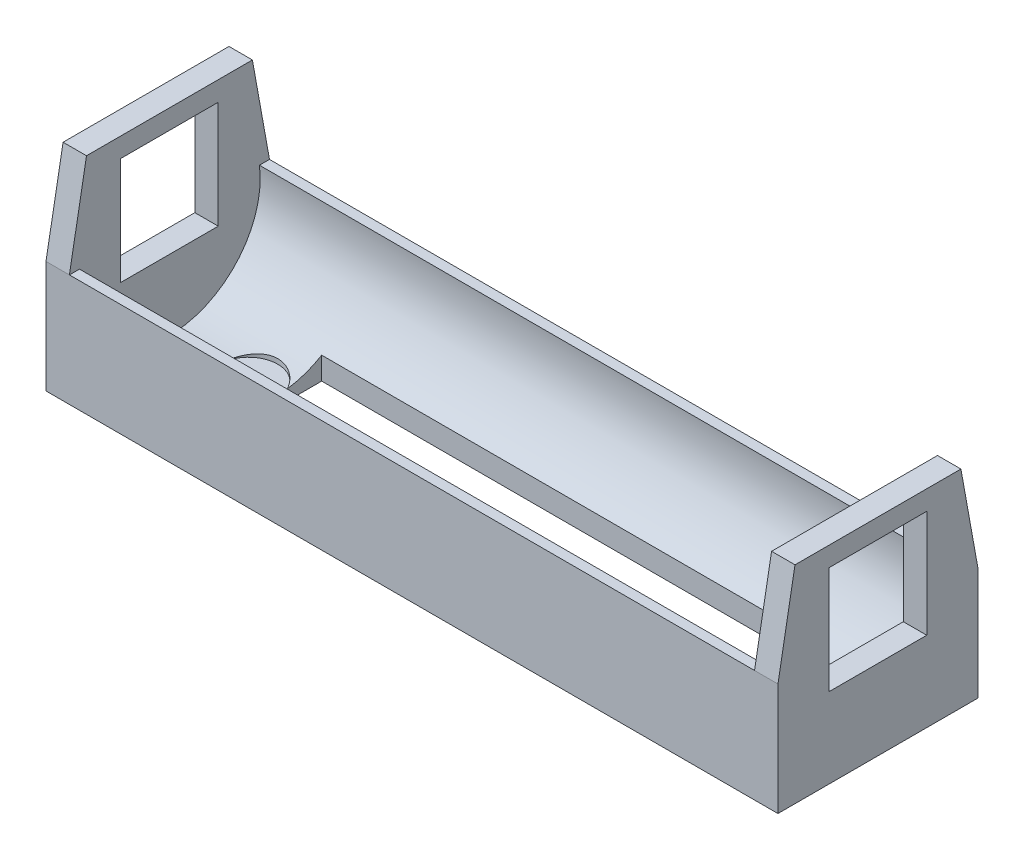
from build123d import *

# Parameters (mm, degrees)
ESQUISSE1_W                  = 10
ESQUISSE1_H                  = 11
BOSS_EXTRU_1_DEPTH           = 37.5
ENL_V_MAT_EXTRU_1_DEPTH      = 45.280385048
ENL_V_MAT_EXTRU_1_DEPTH_BACK = 45.280385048
ESQUISSE2_W                  = 70.2
ESQUISSE2_H                  = 9.7
ESQUISSE3_R                  = 9.3
ENL_V_MAT_EXTRU_2_DEPTH      = 70.2
ESQUISSE4_W                  = 48.5
ESQUISSE4_H                  = 9.5
ENL_V_MAT_EXTRU_4_DEPTH      = 45.280385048
ESQUISSE5_R                  = 1.2
ENL_V_MAT_EXTRU_5_DEPTH      = 45.280385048
ESQUISSE6_R                  = 3
ENL_V_MAT_EXTRU_6_DEPTH      = 44.810415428


with BuildPart() as part:
    # Esquisse1 → Boss.-Extru.1 (new, symmetric)
    with BuildSketch(Plane(origin=(0, 0, 0), x_dir=(0, 0, -1), z_dir=(1, 0, 0))):
        Polygon((-8.5, 21.2), (-10.25, 11.5), (-10.25, 0), (10.25, 0), (10.25, 11.5), (8.5, 21.2), align=None)
        with Locations((0, 13.7)):
            Rectangle(ESQUISSE1_W, ESQUISSE1_H, mode=Mode.SUBTRACT)
    extrude(amount=BOSS_EXTRU_1_DEPTH, both=True)

    # Esquisse2 → Enl_v. mat.-Extru.1 (cut, two sides: drawn at the far end of the back side and taken through both)
    with BuildSketch(Plane.XY.offset(-ENL_V_MAT_EXTRU_1_DEPTH_BACK)):
        with Locations((0, 16.35)):
            Rectangle(ESQUISSE2_W, ESQUISSE2_H)
    extrude(amount=ENL_V_MAT_EXTRU_1_DEPTH + ENL_V_MAT_EXTRU_1_DEPTH_BACK, mode=Mode.SUBTRACT)

    # Esquisse3 → Enl_v. mat.-Extru.2 (cut)
    with BuildSketch(Plane(origin=(-35.1, 0, 0), x_dir=(0, 0, -1), z_dir=(1, 0, 0))):
        with Locations((0, 10.3)):
            Circle(ESQUISSE3_R)
    extrude(amount=ENL_V_MAT_EXTRU_2_DEPTH, mode=Mode.SUBTRACT)

    # Esquisse4 → Enl_v. mat.-Extru.4 (cut, through all)
    with BuildSketch(Plane(origin=(0, 0, 0), x_dir=(1, 0, 0), z_dir=(0, 1, 0))):
        Rectangle(ESQUISSE4_W, ESQUISSE4_H)
    extrude(amount=ENL_V_MAT_EXTRU_4_DEPTH, mode=Mode.SUBTRACT)

    # Esquisse5 → Enl_v. mat.-Extru.5 (cut, through all)
    with BuildSketch(Plane(origin=(0, 0, 0), x_dir=(1, 0, 0), z_dir=(0, 1, 0))):
        with Locations(Location((-27, 0, 0), (0, 0, 90))):
            Circle(ESQUISSE5_R)
        with Locations(Location((27, 0, 0), (0, 0, 90))):
            Circle(ESQUISSE5_R)
    extrude(amount=ENL_V_MAT_EXTRU_5_DEPTH, mode=Mode.SUBTRACT)

    # Esquisse6 → Enl_v. mat.-Extru.6 (cut, through all)
    with BuildSketch(Plane(origin=(0, 1, 0), x_dir=(1, 0, 0), z_dir=(0, 1, 0))):
        with Locations((-27, 0)):
            Circle(ESQUISSE6_R)
        with Locations((27, 0)):
            Circle(ESQUISSE6_R)
    extrude(amount=ENL_V_MAT_EXTRU_6_DEPTH, mode=Mode.SUBTRACT)


solid = part.part
